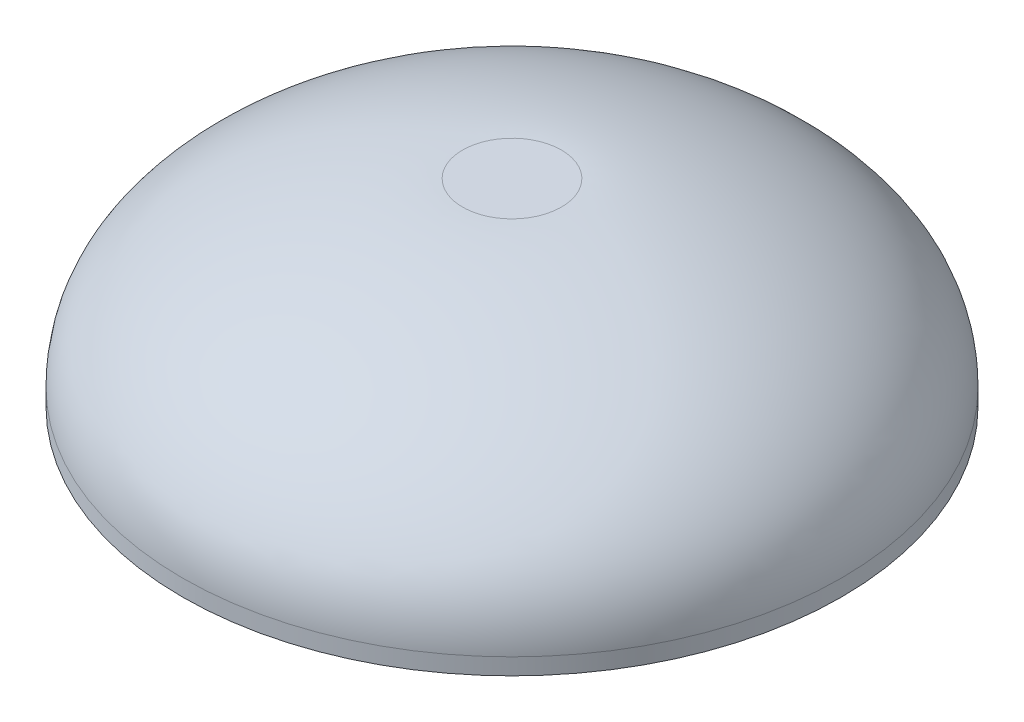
from build123d import *

# Parameters (mm, degrees)
SHELL1_T = -25.4


with BuildPart() as part:
    # Sketch1 → Revolve1 (revolve)
    with BuildSketch(Plane.XY, mode=Mode.PRIVATE) as revolve1_sk:
        with BuildLine():
            Line((0, 0), (0, 152.4))
            Line((0, 152.4), (38.1, 152.4))
            add(Edge.make_bspline(
                [(254, 12.7), (254, 37.469219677), (214.436347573, 116.005034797), (91.182058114, 152.4), (38.1, 152.4)],
                knots=[0, 0, 0, 0, 0.23206871, 1, 1, 1, 1], degree=3))
            Line((254, 12.7), (254, 0))
            Line((254, 0), (0, 0))
        make_face()
    revolve(revolve1_sk.sketch.rotate(Axis((0, 0, 0), (0, 1, 0)), 90), axis=Axis((0, 0, 0), (0, 1, 0)))

    # Shell1
    shell1_openings = [part.faces().sort_by_distance(p)[0] for p in [
        (0, 0, 0),
    ]]
    offset(amount=SHELL1_T, openings=shell1_openings, kind=Kind.INTERSECTION)


solid = part.part
